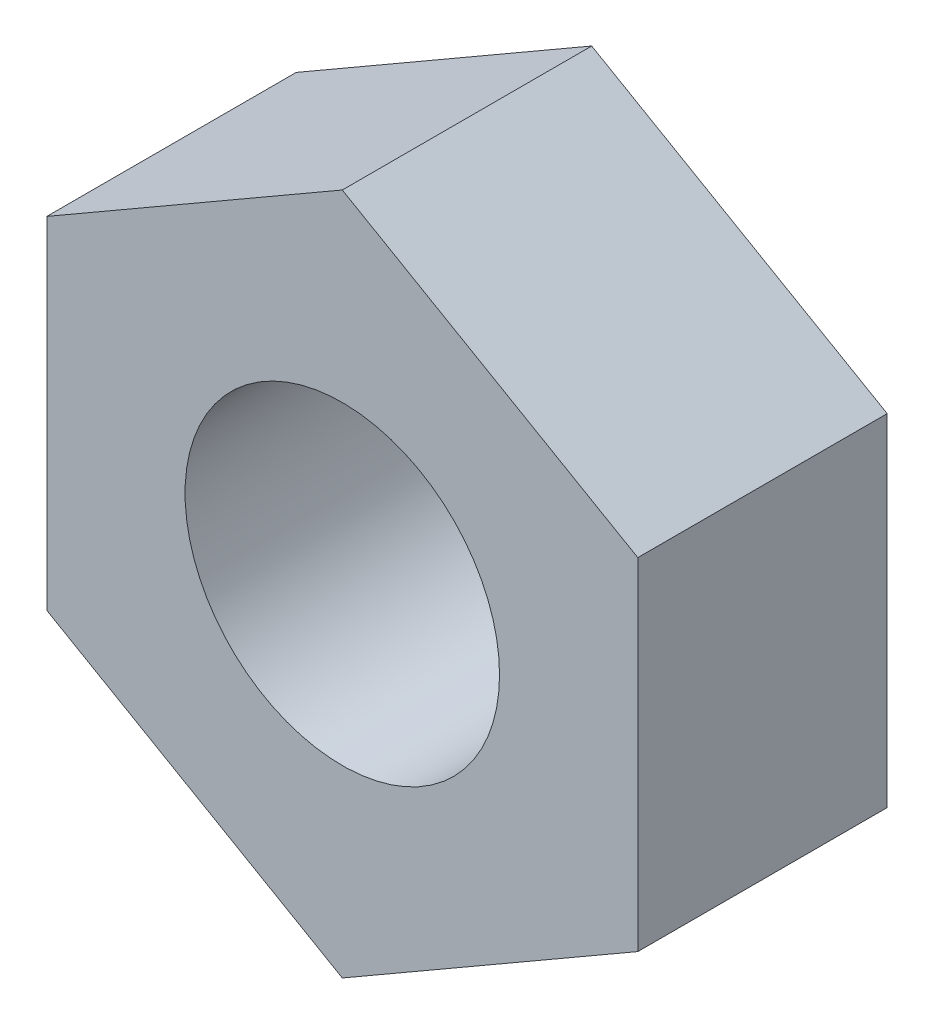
from build123d import *

# Parameters (mm, degrees)
ESQUISSE1_R      = 1.45
EXTRUSION1_DEPTH = 2.3


with BuildPart() as part:
    # Esquisse1 → Extrusion1 (new body)
    with BuildSketch(Plane.XY):
        Polygon((0, 3.146558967), (-2.725, 1.573279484), (-2.725, -1.573279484), (0, -3.146558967), (2.725, -1.573279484), (2.725, 1.573279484), align=None)
        Circle(ESQUISSE1_R, mode=Mode.SUBTRACT)
    extrude(amount=EXTRUSION1_DEPTH)


solid = part.part
